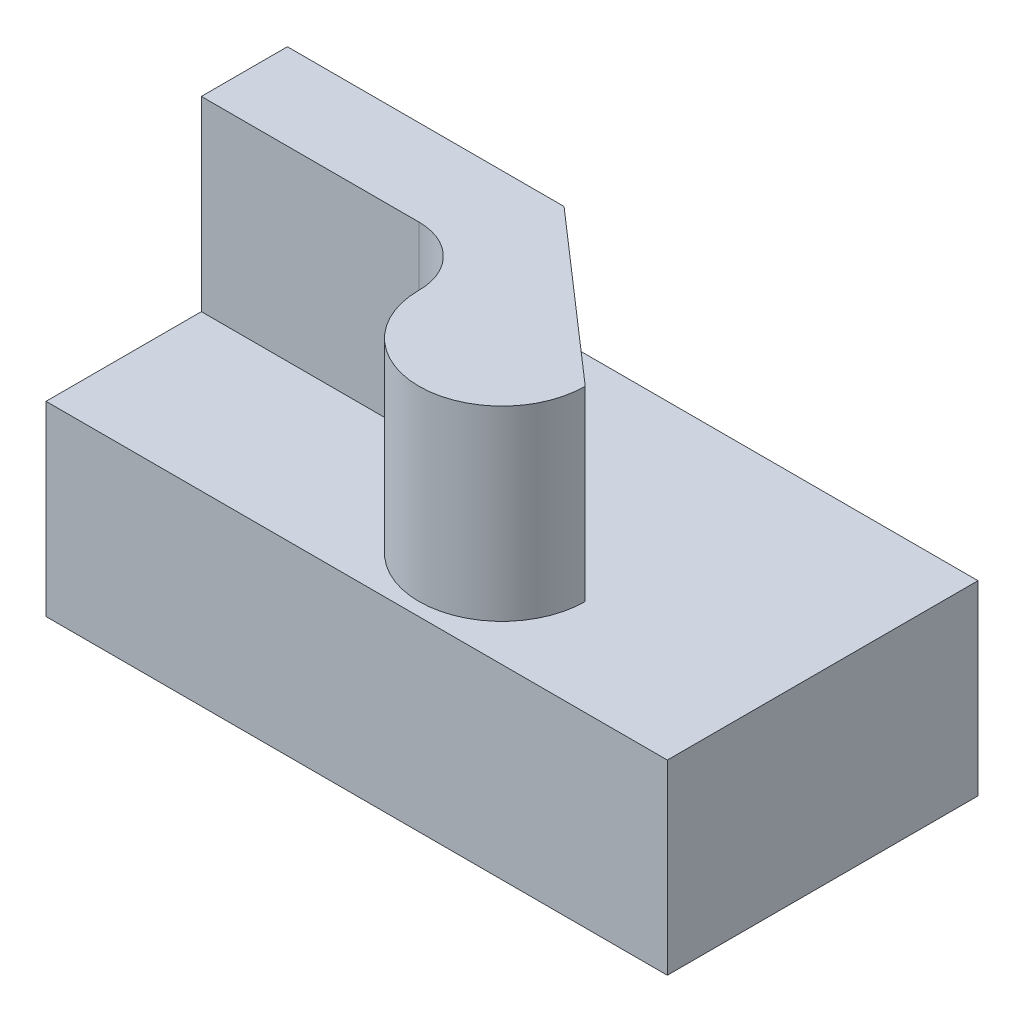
ISO-10303-21;
HEADER;
FILE_DESCRIPTION(('STEP AP214'),'2;1');
FILE_NAME('part.step','',(''),(''),'','','');
FILE_SCHEMA(('AUTOMOTIVE_DESIGN { 1 0 10303 214 1 1 1 1 }'));
ENDSEC;
DATA;
#1=APPLICATION_CONTEXT('core data for automotive mechanical design processes');
#2=APPLICATION_PROTOCOL_DEFINITION('international standard','automotive_design',2000,#1);
#3=PRODUCT_CONTEXT('',#1,'mechanical');
#4=PRODUCT('Part','Part','',(#3));
#5=PRODUCT_RELATED_PRODUCT_CATEGORY('part','',(#4));
#6=PRODUCT_DEFINITION_FORMATION('','',#4);
#7=PRODUCT_DEFINITION_CONTEXT('part definition',#1,'design');
#8=PRODUCT_DEFINITION('design','',#6,#7);
#9=PRODUCT_DEFINITION_SHAPE('','',#8);
#10=(LENGTH_UNIT() NAMED_UNIT(*) SI_UNIT(.MILLI.,.METRE.));
#11=(NAMED_UNIT(*) PLANE_ANGLE_UNIT() SI_UNIT($,.RADIAN.));
#12=(NAMED_UNIT(*) SI_UNIT($,.STERADIAN.) SOLID_ANGLE_UNIT());
#13=UNCERTAINTY_MEASURE_WITH_UNIT(LENGTH_MEASURE(1.E-05),#10,'distance_accuracy_value','');
#14=(GEOMETRIC_REPRESENTATION_CONTEXT(3) GLOBAL_UNCERTAINTY_ASSIGNED_CONTEXT((#13)) GLOBAL_UNIT_ASSIGNED_CONTEXT((#10,
#11,#12)) REPRESENTATION_CONTEXT('',''));
#15=CARTESIAN_POINT('',(0.,0.,0.));
#16=DIRECTION('',(0.,0.,1.));
#17=DIRECTION('',(1.,0.,0.));
#18=AXIS2_PLACEMENT_3D('',#15,#16,#17);
#19=CARTESIAN_POINT('',(0.,30.,-50.));
#20=DIRECTION('',(0.,-1.,0.));
#21=DIRECTION('',(0.,0.,-1.));
#22=AXIS2_PLACEMENT_3D('',#19,#20,#21);
#23=PLANE('',#22);
#24=DIRECTION('',(-1.,0.,0.));
#25=VECTOR('',#24,1.);
#26=CARTESIAN_POINT('',(44.529498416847,30.,-38.8486710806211));
#27=LINE('',#26,#25);
#28=CARTESIAN_POINT('',(44.529498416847,30.,-38.8486710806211));
#29=VERTEX_POINT('',#28);
#30=CARTESIAN_POINT('',(0.,30.,-38.8486710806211));
#31=VERTEX_POINT('',#30);
#32=EDGE_CURVE('E50',#29,#31,#27,.T.);
#33=ORIENTED_EDGE('',*,*,#32,.F.);
#34=DIRECTION('',(-0.753433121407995,0.,-0.657524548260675));
#35=VECTOR('',#34,1.);
#36=CARTESIAN_POINT('',(71.2946414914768,30.,-15.4906076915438));
#37=LINE('',#36,#35);
#38=CARTESIAN_POINT('',(71.2946414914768,30.,-15.4906076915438));
#39=VERTEX_POINT('',#38);
#40=EDGE_CURVE('E54',#39,#29,#37,.T.);
#41=ORIENTED_EDGE('',*,*,#40,.F.);
#42=CARTESIAN_POINT('',(57.9120699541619,30.,-15.4906076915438));
#43=DIRECTION('',(0.,1.,0.));
#44=DIRECTION('',(0.,0.,1.));
#45=AXIS2_PLACEMENT_3D('',#42,#43,#44);
#46=CIRCLE('',#45,13.3825715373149);
#47=CARTESIAN_POINT('',(44.529498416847,30.,-15.4906076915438));
#48=VERTEX_POINT('',#47);
#49=EDGE_CURVE('E112',#48,#39,#46,.T.);
#50=ORIENTED_EDGE('',*,*,#49,.F.);
#51=CARTESIAN_POINT('',(35.0201061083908,30.,-15.4906076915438));
#52=DIRECTION('',(0.,-1.,0.));
#53=DIRECTION('',(0.,0.,-1.));
#54=AXIS2_PLACEMENT_3D('',#51,#52,#53);
#55=CIRCLE('',#54,9.5093923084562);
#56=CARTESIAN_POINT('',(35.0201061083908,30.,-25.));
#57=VERTEX_POINT('',#56);
#58=EDGE_CURVE('E108',#57,#48,#55,.T.);
#59=ORIENTED_EDGE('',*,*,#58,.F.);
#60=DIRECTION('',(1.,0.,0.));
#61=VECTOR('',#60,1.);
#62=CARTESIAN_POINT('',(0.,30.,-25.));
#63=LINE('',#62,#61);
#64=CARTESIAN_POINT('',(0.,30.,-25.));
#65=VERTEX_POINT('',#64);
#66=EDGE_CURVE('E110',#65,#57,#63,.T.);
#67=ORIENTED_EDGE('',*,*,#66,.F.);
#68=DIRECTION('',(0.,0.,1.));
#69=VECTOR('',#68,1.);
#70=CARTESIAN_POINT('',(0.,30.,0.));
#71=LINE('',#70,#69);
#72=CARTESIAN_POINT('',(0.,30.,0.));
#73=VERTEX_POINT('',#72);
#74=EDGE_CURVE('E145',#65,#73,#71,.T.);
#75=ORIENTED_EDGE('',*,*,#74,.T.);
#76=DIRECTION('',(1.,0.,0.));
#77=VECTOR('',#76,1.);
#78=CARTESIAN_POINT('',(0.,30.,0.));
#79=LINE('',#78,#77);
#80=CARTESIAN_POINT('',(100.,30.,0.));
#81=VERTEX_POINT('',#80);
#82=EDGE_CURVE('E148',#73,#81,#79,.T.);
#83=ORIENTED_EDGE('',*,*,#82,.T.);
#84=DIRECTION('',(0.,0.,-1.));
#85=VECTOR('',#84,1.);
#86=CARTESIAN_POINT('',(100.,30.,0.));
#87=LINE('',#86,#85);
#88=CARTESIAN_POINT('',(100.,30.,-50.));
#89=VERTEX_POINT('',#88);
#90=EDGE_CURVE('E164',#81,#89,#87,.T.);
#91=ORIENTED_EDGE('',*,*,#90,.T.);
#92=DIRECTION('',(-1.,0.,0.));
#93=VECTOR('',#92,1.);
#94=CARTESIAN_POINT('',(0.,30.,-50.));
#95=LINE('',#94,#93);
#96=CARTESIAN_POINT('',(0.,30.,-50.));
#97=VERTEX_POINT('',#96);
#98=EDGE_CURVE('E163',#89,#97,#95,.T.);
#99=ORIENTED_EDGE('',*,*,#98,.T.);
#100=EDGE_CURVE('E153',#97,#31,#71,.T.);
#101=ORIENTED_EDGE('',*,*,#100,.T.);
#102=EDGE_LOOP('',(#33,#41,#50,#59,#67,#75,#83,#91,#99,#101));
#103=FACE_BOUND('',#102,.T.);
#104=ADVANCED_FACE('F33',(#103),#23,.F.);
#105=CARTESIAN_POINT('',(0.,30.,0.));
#106=DIRECTION('',(1.,0.,0.));
#107=DIRECTION('',(0.,0.,-1.));
#108=AXIS2_PLACEMENT_3D('',#105,#106,#107);
#109=PLANE('',#108);
#110=DIRECTION('',(0.,0.,1.));
#111=VECTOR('',#110,1.);
#112=CARTESIAN_POINT('',(0.,0.,0.));
#113=LINE('',#112,#111);
#114=CARTESIAN_POINT('',(0.,0.,-50.));
#115=VERTEX_POINT('',#114);
#116=CARTESIAN_POINT('',(0.,0.,0.));
#117=VERTEX_POINT('',#116);
#118=EDGE_CURVE('E131',#115,#117,#113,.T.);
#119=ORIENTED_EDGE('',*,*,#118,.T.);
#120=DIRECTION('',(0.,-1.,0.));
#121=VECTOR('',#120,1.);
#122=CARTESIAN_POINT('',(0.,30.,0.));
#123=LINE('',#122,#121);
#124=EDGE_CURVE('E11',#73,#117,#123,.T.);
#125=ORIENTED_EDGE('',*,*,#124,.F.);
#126=ORIENTED_EDGE('',*,*,#74,.F.);
#127=DIRECTION('',(0.,-1.,0.));
#128=VECTOR('',#127,1.);
#129=CARTESIAN_POINT('',(0.,60.,-25.));
#130=LINE('',#129,#128);
#131=CARTESIAN_POINT('',(0.,60.,-25.));
#132=VERTEX_POINT('',#131);
#133=EDGE_CURVE('E125',#132,#65,#130,.T.);
#134=ORIENTED_EDGE('',*,*,#133,.F.);
#135=DIRECTION('',(0.,0.,1.));
#136=VECTOR('',#135,1.);
#137=CARTESIAN_POINT('',(0.,60.,-38.8486710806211));
#138=LINE('',#137,#136);
#139=CARTESIAN_POINT('',(0.,60.,-38.8486710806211));
#140=VERTEX_POINT('',#139);
#141=EDGE_CURVE('E192',#140,#132,#138,.T.);
#142=ORIENTED_EDGE('',*,*,#141,.F.);
#143=DIRECTION('',(0.,-1.,0.));
#144=VECTOR('',#143,1.);
#145=CARTESIAN_POINT('',(0.,60.,-38.8486710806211));
#146=LINE('',#145,#144);
#147=EDGE_CURVE('E188',#140,#31,#146,.T.);
#148=ORIENTED_EDGE('',*,*,#147,.T.);
#149=ORIENTED_EDGE('',*,*,#100,.F.);
#150=DIRECTION('',(0.,-1.,0.));
#151=VECTOR('',#150,1.);
#152=CARTESIAN_POINT('',(0.,30.,-50.));
#153=LINE('',#152,#151);
#154=EDGE_CURVE('E160',#97,#115,#153,.T.);
#155=ORIENTED_EDGE('',*,*,#154,.T.);
#156=EDGE_LOOP('',(#119,#125,#126,#134,#142,#148,#149,#155));
#157=FACE_BOUND('',#156,.T.);
#158=ADVANCED_FACE('F35',(#157),#109,.F.);
#159=CARTESIAN_POINT('',(0.,30.,0.));
#160=DIRECTION('',(0.,0.,-1.));
#161=DIRECTION('',(-1.,0.,0.));
#162=AXIS2_PLACEMENT_3D('',#159,#160,#161);
#163=PLANE('',#162);
#164=DIRECTION('',(1.,0.,0.));
#165=VECTOR('',#164,1.);
#166=CARTESIAN_POINT('',(0.,0.,0.));
#167=LINE('',#166,#165);
#168=CARTESIAN_POINT('',(100.,0.,0.));
#169=VERTEX_POINT('',#168);
#170=EDGE_CURVE('E139',#117,#169,#167,.T.);
#171=ORIENTED_EDGE('',*,*,#170,.T.);
#172=DIRECTION('',(0.,-1.,0.));
#173=VECTOR('',#172,1.);
#174=CARTESIAN_POINT('',(100.,30.,0.));
#175=LINE('',#174,#173);
#176=EDGE_CURVE('E42',#81,#169,#175,.T.);
#177=ORIENTED_EDGE('',*,*,#176,.F.);
#178=ORIENTED_EDGE('',*,*,#82,.F.);
#179=ORIENTED_EDGE('',*,*,#124,.T.);
#180=EDGE_LOOP('',(#171,#177,#178,#179));
#181=FACE_BOUND('',#180,.T.);
#182=ADVANCED_FACE('F171',(#181),#163,.F.);
#183=CARTESIAN_POINT('',(100.,30.,0.));
#184=DIRECTION('',(-1.,0.,0.));
#185=DIRECTION('',(0.,0.,1.));
#186=AXIS2_PLACEMENT_3D('',#183,#184,#185);
#187=PLANE('',#186);
#188=DIRECTION('',(0.,0.,-1.));
#189=VECTOR('',#188,1.);
#190=CARTESIAN_POINT('',(100.,0.,0.));
#191=LINE('',#190,#189);
#192=CARTESIAN_POINT('',(100.,0.,-50.));
#193=VERTEX_POINT('',#192);
#194=EDGE_CURVE('E141',#169,#193,#191,.T.);
#195=ORIENTED_EDGE('',*,*,#194,.T.);
#196=DIRECTION('',(0.,-1.,0.));
#197=VECTOR('',#196,1.);
#198=CARTESIAN_POINT('',(100.,30.,-50.));
#199=LINE('',#198,#197);
#200=EDGE_CURVE('E157',#89,#193,#199,.T.);
#201=ORIENTED_EDGE('',*,*,#200,.F.);
#202=ORIENTED_EDGE('',*,*,#90,.F.);
#203=ORIENTED_EDGE('',*,*,#176,.T.);
#204=EDGE_LOOP('',(#195,#201,#202,#203));
#205=FACE_BOUND('',#204,.T.);
#206=ADVANCED_FACE('F174',(#205),#187,.F.);
#207=CARTESIAN_POINT('',(0.,30.,-50.));
#208=DIRECTION('',(0.,0.,1.));
#209=DIRECTION('',(1.,0.,0.));
#210=AXIS2_PLACEMENT_3D('',#207,#208,#209);
#211=PLANE('',#210);
#212=DIRECTION('',(-1.,0.,0.));
#213=VECTOR('',#212,1.);
#214=CARTESIAN_POINT('',(0.,0.,-50.));
#215=LINE('',#214,#213);
#216=EDGE_CURVE('E143',#193,#115,#215,.T.);
#217=ORIENTED_EDGE('',*,*,#216,.T.);
#218=ORIENTED_EDGE('',*,*,#154,.F.);
#219=ORIENTED_EDGE('',*,*,#98,.F.);
#220=ORIENTED_EDGE('',*,*,#200,.T.);
#221=EDGE_LOOP('',(#217,#218,#219,#220));
#222=FACE_BOUND('',#221,.T.);
#223=ADVANCED_FACE('F179',(#222),#211,.F.);
#224=CARTESIAN_POINT('',(0.,0.,-50.));
#225=DIRECTION('',(0.,-1.,0.));
#226=DIRECTION('',(0.,0.,-1.));
#227=AXIS2_PLACEMENT_3D('',#224,#225,#226);
#228=PLANE('',#227);
#229=ORIENTED_EDGE('',*,*,#118,.F.);
#230=ORIENTED_EDGE('',*,*,#216,.F.);
#231=ORIENTED_EDGE('',*,*,#194,.F.);
#232=ORIENTED_EDGE('',*,*,#170,.F.);
#233=EDGE_LOOP('',(#229,#230,#231,#232));
#234=FACE_BOUND('',#233,.T.);
#235=ADVANCED_FACE('F224',(#234),#228,.T.);
#236=CARTESIAN_POINT('',(0.,60.,-25.));
#237=DIRECTION('',(0.,0.,-1.));
#238=DIRECTION('',(-1.,0.,0.));
#239=AXIS2_PLACEMENT_3D('',#236,#237,#238);
#240=PLANE('',#239);
#241=ORIENTED_EDGE('',*,*,#66,.T.);
#242=DIRECTION('',(0.,-1.,0.));
#243=VECTOR('',#242,1.);
#244=CARTESIAN_POINT('',(35.0201061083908,60.,-25.));
#245=LINE('',#244,#243);
#246=CARTESIAN_POINT('',(35.0201061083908,60.,-25.));
#247=VERTEX_POINT('',#246);
#248=EDGE_CURVE('E122',#247,#57,#245,.T.);
#249=ORIENTED_EDGE('',*,*,#248,.F.);
#250=DIRECTION('',(1.,0.,0.));
#251=VECTOR('',#250,1.);
#252=CARTESIAN_POINT('',(0.,60.,-25.));
#253=LINE('',#252,#251);
#254=EDGE_CURVE('E207',#132,#247,#253,.T.);
#255=ORIENTED_EDGE('',*,*,#254,.F.);
#256=ORIENTED_EDGE('',*,*,#133,.T.);
#257=EDGE_LOOP('',(#241,#249,#255,#256));
#258=FACE_BOUND('',#257,.T.);
#259=ADVANCED_FACE('F121',(#258),#240,.F.);
#260=CARTESIAN_POINT('',(35.0201061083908,60.,-15.4906076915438));
#261=DIRECTION('',(0.,-1.,0.));
#262=DIRECTION('',(0.,0.,-1.));
#263=AXIS2_PLACEMENT_3D('',#260,#261,#262);
#264=CYLINDRICAL_SURFACE('',#263,9.5093923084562);
#265=ORIENTED_EDGE('',*,*,#58,.T.);
#266=DIRECTION('',(0.,-1.,0.));
#267=VECTOR('',#266,1.);
#268=CARTESIAN_POINT('',(44.529498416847,60.,-15.4906076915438));
#269=LINE('',#268,#267);
#270=CARTESIAN_POINT('',(44.529498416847,60.,-15.4906076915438));
#271=VERTEX_POINT('',#270);
#272=EDGE_CURVE('E129',#271,#48,#269,.T.);
#273=ORIENTED_EDGE('',*,*,#272,.F.);
#274=CARTESIAN_POINT('',(35.0201061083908,60.,-15.4906076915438));
#275=DIRECTION('',(0.,-1.,0.));
#276=DIRECTION('',(0.,0.,-1.));
#277=AXIS2_PLACEMENT_3D('',#274,#275,#276);
#278=CIRCLE('',#277,9.5093923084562);
#279=EDGE_CURVE('E128',#247,#271,#278,.T.);
#280=ORIENTED_EDGE('',*,*,#279,.F.);
#281=ORIENTED_EDGE('',*,*,#248,.T.);
#282=EDGE_LOOP('',(#265,#273,#280,#281));
#283=FACE_BOUND('',#282,.T.);
#284=ADVANCED_FACE('F127',(#283),#264,.F.);
#285=CARTESIAN_POINT('',(57.9120699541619,60.,-15.4906076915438));
#286=DIRECTION('',(0.,-1.,0.));
#287=DIRECTION('',(0.,0.,-1.));
#288=AXIS2_PLACEMENT_3D('',#285,#286,#287);
#289=CYLINDRICAL_SURFACE('',#288,13.3825715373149);
#290=ORIENTED_EDGE('',*,*,#49,.T.);
#291=DIRECTION('',(0.,-1.,0.));
#292=VECTOR('',#291,1.);
#293=CARTESIAN_POINT('',(71.2946414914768,60.,-15.4906076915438));
#294=LINE('',#293,#292);
#295=CARTESIAN_POINT('',(71.2946414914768,60.,-15.4906076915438));
#296=VERTEX_POINT('',#295);
#297=EDGE_CURVE('E133',#296,#39,#294,.T.);
#298=ORIENTED_EDGE('',*,*,#297,.F.);
#299=CARTESIAN_POINT('',(57.9120699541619,60.,-15.4906076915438));
#300=DIRECTION('',(0.,1.,0.));
#301=DIRECTION('',(0.,0.,1.));
#302=AXIS2_PLACEMENT_3D('',#299,#300,#301);
#303=CIRCLE('',#302,13.3825715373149);
#304=EDGE_CURVE('E210',#271,#296,#303,.T.);
#305=ORIENTED_EDGE('',*,*,#304,.F.);
#306=ORIENTED_EDGE('',*,*,#272,.T.);
#307=EDGE_LOOP('',(#290,#298,#305,#306));
#308=FACE_BOUND('',#307,.T.);
#309=ADVANCED_FACE('F219',(#308),#289,.T.);
#310=CARTESIAN_POINT('',(71.2946414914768,60.,-15.4906076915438));
#311=DIRECTION('',(-0.657524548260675,0.,0.753433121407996));
#312=DIRECTION('',(0.753433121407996,0.,0.657524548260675));
#313=AXIS2_PLACEMENT_3D('',#310,#311,#312);
#314=PLANE('',#313);
#315=ORIENTED_EDGE('',*,*,#40,.T.);
#316=DIRECTION('',(0.,-1.,0.));
#317=VECTOR('',#316,1.);
#318=CARTESIAN_POINT('',(44.529498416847,60.,-38.8486710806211));
#319=LINE('',#318,#317);
#320=CARTESIAN_POINT('',(44.529498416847,60.,-38.8486710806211));
#321=VERTEX_POINT('',#320);
#322=EDGE_CURVE('E191',#321,#29,#319,.T.);
#323=ORIENTED_EDGE('',*,*,#322,.F.);
#324=DIRECTION('',(-0.753433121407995,0.,-0.657524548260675));
#325=VECTOR('',#324,1.);
#326=CARTESIAN_POINT('',(71.2946414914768,60.,-15.4906076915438));
#327=LINE('',#326,#325);
#328=EDGE_CURVE('E197',#296,#321,#327,.T.);
#329=ORIENTED_EDGE('',*,*,#328,.F.);
#330=ORIENTED_EDGE('',*,*,#297,.T.);
#331=EDGE_LOOP('',(#315,#323,#329,#330));
#332=FACE_BOUND('',#331,.T.);
#333=ADVANCED_FACE('F216',(#332),#314,.F.);
#334=CARTESIAN_POINT('',(44.529498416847,60.,-38.8486710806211));
#335=DIRECTION('',(0.,0.,1.));
#336=DIRECTION('',(1.,0.,0.));
#337=AXIS2_PLACEMENT_3D('',#334,#335,#336);
#338=PLANE('',#337);
#339=ORIENTED_EDGE('',*,*,#32,.T.);
#340=ORIENTED_EDGE('',*,*,#147,.F.);
#341=DIRECTION('',(-1.,0.,0.));
#342=VECTOR('',#341,1.);
#343=CARTESIAN_POINT('',(44.529498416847,60.,-38.8486710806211));
#344=LINE('',#343,#342);
#345=EDGE_CURVE('E195',#321,#140,#344,.T.);
#346=ORIENTED_EDGE('',*,*,#345,.F.);
#347=ORIENTED_EDGE('',*,*,#322,.T.);
#348=EDGE_LOOP('',(#339,#340,#346,#347));
#349=FACE_BOUND('',#348,.T.);
#350=ADVANCED_FACE('F186',(#349),#338,.F.);
#351=CARTESIAN_POINT('',(35.0201061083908,60.,-15.4906076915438));
#352=DIRECTION('',(0.,-1.,0.));
#353=DIRECTION('',(0.,0.,-1.));
#354=AXIS2_PLACEMENT_3D('',#351,#352,#353);
#355=PLANE('',#354);
#356=ORIENTED_EDGE('',*,*,#141,.T.);
#357=ORIENTED_EDGE('',*,*,#254,.T.);
#358=ORIENTED_EDGE('',*,*,#279,.T.);
#359=ORIENTED_EDGE('',*,*,#304,.T.);
#360=ORIENTED_EDGE('',*,*,#328,.T.);
#361=ORIENTED_EDGE('',*,*,#345,.T.);
#362=EDGE_LOOP('',(#356,#357,#358,#359,#360,#361));
#363=FACE_BOUND('',#362,.T.);
#364=ADVANCED_FACE('F221',(#363),#355,.F.);
#365=CLOSED_SHELL('',(#104,#158,#182,#206,#223,#235,#259,#284,#309,#333,#350,#364));
#366=MANIFOLD_SOLID_BREP('B2',#365);
#367=ADVANCED_BREP_SHAPE_REPRESENTATION('',(#18,#366),#14);
#368=SHAPE_DEFINITION_REPRESENTATION(#9,#367);
ENDSEC;
END-ISO-10303-21;
